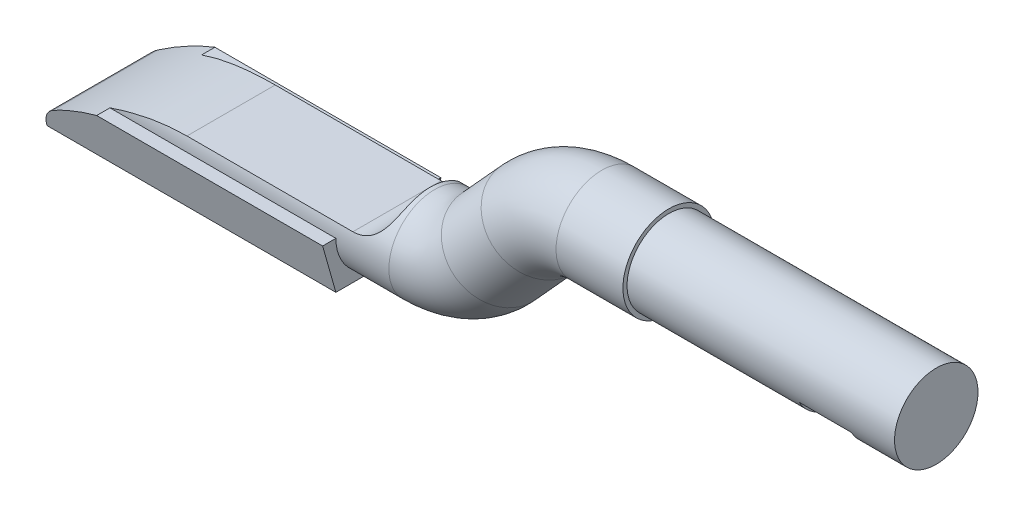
from build123d import *

# Parameters (mm, degrees)
SKETCH3_R               = 4.3561
SKETCH4_R               = 4.7625
SKETCH4_R_2             = 3.9624
CUT_EXTRUDE1_DEPTH      = 25.4
CUT_EXTRUDE2_DEPTH      = 82.396928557
CUT_EXTRUDE2_DEPTH_BACK = 82.396928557
SKETCH5_W               = 4.953
SKETCH5_H               = 3.81
BOSS_EXTRUDE1_DEPTH     = 27.432
CUT_EXTRUDE3_DEPTH      = 82.489082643
CUT_EXTRUDE3_DEPTH_BACK = 82.489082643
CUT_EXTRUDE4_DEPTH      = 82.489082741
CUT_EXTRUDE4_DEPTH_BACK = 82.489082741


with BuildPart() as part:
    # Sweep1: sweep along a path in Sketch2
    with BuildLine(Plane.XY) as sweep1_path:
        Line((0, 0), (-31.75, 0))
        ThreePointArc((-31.75, 0), (-35.058022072, -0.700031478), (-37.798889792, -2.68010679))
        Line((-37.798889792, -2.68010679), (-41.576110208, -6.84489321))
        ThreePointArc((-41.576110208, -6.84489321), (-44.316977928, -8.824968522), (-47.625, -9.525))
        Line((-47.625, -9.525), (-80.0862, -9.525))
    # Sketch3 → Sweep1 (sweep)
    with BuildSketch(Plane(origin=(0, 0, 0), x_dir=(0, 0, -1), z_dir=(1, 0, 0))):
        Circle(SKETCH3_R)
    sweep(path=sweep1_path.line)

    # Sketch4 → Cut-Extrude1 (cut)
    with BuildSketch(Plane(origin=(0, 0, 0), x_dir=(0, 0, -1), z_dir=(1, 0, 0))):
        Circle(SKETCH4_R)
        Circle(SKETCH4_R_2, mode=Mode.SUBTRACT)
    extrude(amount=-CUT_EXTRUDE1_DEPTH, mode=Mode.SUBTRACT)

    # Sketch5 → Cut-Extrude2 (cut, two sides: drawn at the far end of the back side and taken through both)
    with BuildSketch(Plane.XY.offset(-CUT_EXTRUDE2_DEPTH_BACK)):
        with Locations((-7.0485, -3.7846)):
            Rectangle(SKETCH5_W, SKETCH5_H)
    extrude(amount=CUT_EXTRUDE2_DEPTH + CUT_EXTRUDE2_DEPTH_BACK, mode=Mode.SUBTRACT)

    # Sketch6 → Boss-Extrude1 (add)
    with BuildSketch(Plane.ZY.offset(80.0862)):
        Polygon((4.3561, -13.97), (-4.3561, -13.97), (-5.6134, -9.525), (5.6134, -9.525), align=None)
    extrude(amount=-BOSS_EXTRUDE1_DEPTH)

    # Sketch7 → Cut-Extrude3 (cut, two sides: drawn at the far end of the back side and taken through both)
    with BuildSketch(Plane.XY.offset(-CUT_EXTRUDE3_DEPTH_BACK)):
        with BuildLine():
            Line((-80.0862, -3.2639), (-48.0314, -3.2639))
            Line((-48.0314, -3.2639), (-48.0314, -5.1689))
            ThreePointArc((-48.0314, -5.1689), (-48.96133597, -7.41396403), (-51.2064, -8.3439))
            Line((-51.2064, -8.3439), (-80.0862, -8.3439))
            Line((-80.0862, -8.3439), (-80.0862, -3.2639))
        make_face()
    extrude(amount=CUT_EXTRUDE3_DEPTH + CUT_EXTRUDE3_DEPTH_BACK, mode=Mode.SUBTRACT)

    # Sketch8 → Cut-Extrude4 (cut, two sides: drawn at the far end of the back side and taken through both)
    with BuildSketch(Plane.XY.offset(-CUT_EXTRUDE4_DEPTH_BACK)):
        with BuildLine():
            Line((-80.0862, -13.97), (-80.0862, -8.3439))
            Line((-80.0862, -8.3439), (-66.964340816, -8.3439))
            ThreePointArc((-66.964340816, -8.3439), (-73.186828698, -9.232750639), (-78.911601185, -11.828206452))
            ThreePointArc((-78.911601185, -11.828206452), (-79.773274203, -12.748631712), (-80.0862, -13.97))
        make_face()
    extrude(amount=CUT_EXTRUDE4_DEPTH + CUT_EXTRUDE4_DEPTH_BACK, mode=Mode.SUBTRACT)


solid = part.part
